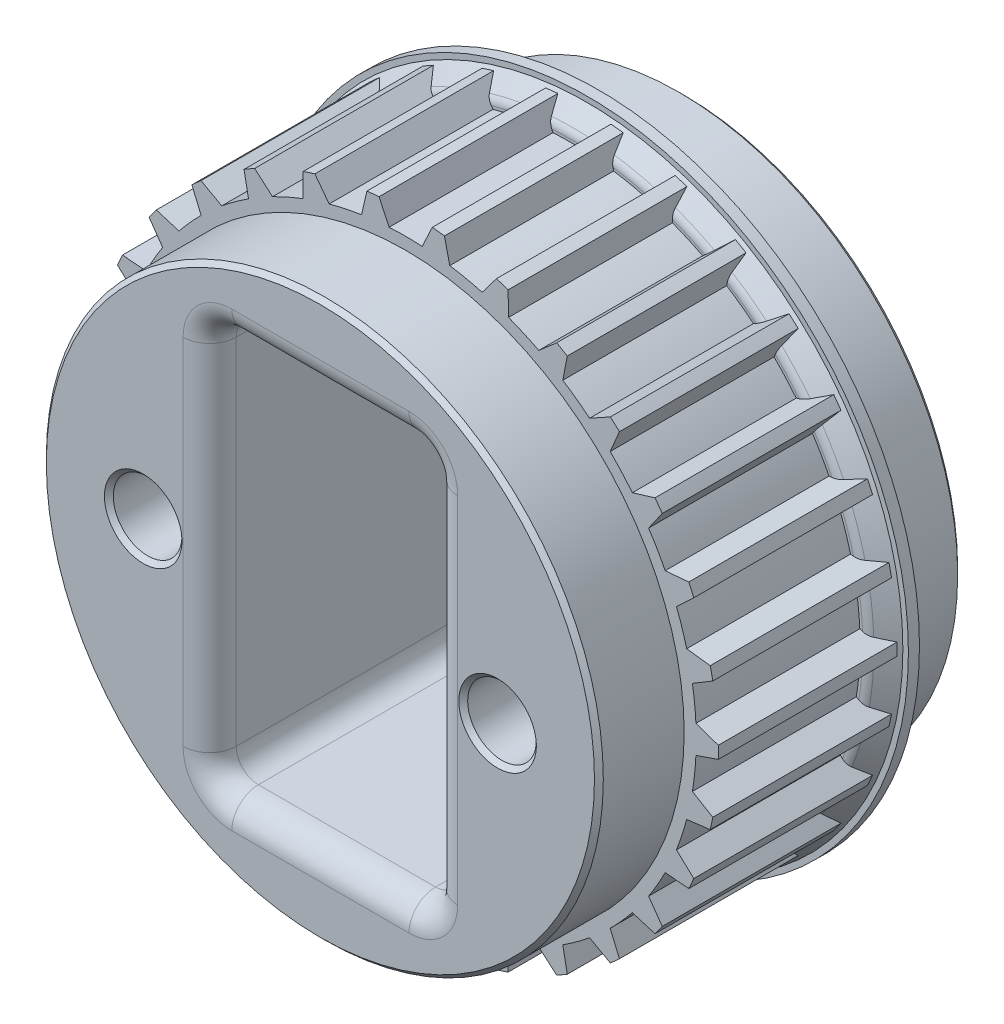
from build123d import *

# Parameters (mm, degrees)
SCHNITT_LINEAR_AUSTRAGEN1_DEPTH      = 22.586773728
KREISMUSTER1_COUNT                   = 30
SCHNITT_LINEAR_AUSTRAGEN2_DEPTH      = 23.084836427
SCHNITT_LINEAR_AUSTRAGEN2_DEPTH_BACK = 23.084836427
SKIZZE4_R                            = 1.55
VERRUNDUNG1_R                        = 1.2
FASE1_SIZE                           = 0.2


with BuildPart() as part:
    # Skizze1 → Rotation1 (revolve)
    with BuildSketch(Plane(origin=(0, 0, 0), x_dir=(0, 0, -1), z_dir=(1, 0, 0)), mode=Mode.PRIVATE) as rotation1_sk:
        Polygon((-4.35, 14.12), (4.35, 14.12), (4.35, 12.575), (8.2, 12.575), (8.2, 0), (-8.2, 0), (-8.2, 12.575), (-4.35, 12.575), align=None)
    revolve(rotation1_sk.sketch.rotate(Axis((0, 0, 46.515199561), (0, 0, -1)), 90), axis=Axis((0, 0, 46.515199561), (0, 0, -1)))

    # Skizze2 → Schnitt-Linear austragen1 (cut, symmetric)
    with BuildSketch(Plane.XY):
        with BuildLine():
            Line((-1.2, 14.068916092), (-0.747573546, 13.09868443))
            ThreePointArc((-0.747573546, 13.09868443), (0, 13.12), (0.747573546, 13.09868443))
            Line((0.747573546, 13.09868443), (1.2, 14.068916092))
            ThreePointArc((1.2, 14.068916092), (0, 14.12), (-1.2, 14.068916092))
        make_face()
    schnitt_linear_austragen1 = extrude(amount=SCHNITT_LINEAR_AUSTRAGEN1_DEPTH, both=True, mode=Mode.SUBTRACT)

    # Kreismuster1: Schnitt-Linear austragen1 ×30 about axis
    kreismuster1_axis = Axis((0, 0, 0), (0, 0, 1))
    for i in range(1, KREISMUSTER1_COUNT):
        add(schnitt_linear_austragen1.rotate(kreismuster1_axis, i * 360 / KREISMUSTER1_COUNT), mode=Mode.SUBTRACT)

    # Skizze3 → Rotation2 (revolve)
    with BuildSketch(Plane(origin=(0, 0, 0), x_dir=(0, 0, -1), z_dir=(1, 0, 0)), mode=Mode.PRIVATE) as rotation2_sk:
        with BuildLine():
            Line((4.35, 13), (4.35, 14.5))
            Line((4.35, 14.5), (3.85, 14.5))
            Line((3.85, 14.5), (3.85, 14.25))
            Line((3.85, 14.25), (3.196446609, 13.596446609))
            ThreePointArc((3.196446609, 13.596446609), (3.088060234, 13.434234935), (3.05, 13.242893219))
            Line((3.05, 13.242893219), (3.05, 13))
            Line((3.05, 13), (4.35, 13))
        make_face()
    revolve(rotation2_sk.sketch.rotate(Axis((0, 0, -11.03129214), (0, 0, 1)), 90), axis=Axis((0, 0, -11.03129214), (0, 0, 1)))

    # Skizze4 → Schnitt-Linear austragen2 (cut, two sides: drawn at the far end of the back side and taken through both)
    with BuildSketch(Plane.XY.offset(-SCHNITT_LINEAR_AUSTRAGEN2_DEPTH_BACK)):
        with Locations((-8, 0)):
            Circle(SKIZZE4_R)
        with Locations(Location((8, 0, 0), (0, 0, 180))):
            Circle(SKIZZE4_R)
        with BuildLine():
            Line((4, 9), (-4, 9))
            ThreePointArc((-4, 9), (-4.707106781, 8.707106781), (-5, 8))
            Line((-5, 8), (-5, -8))
            ThreePointArc((-5, -8), (-4.707106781, -8.707106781), (-4, -9))
            Line((-4, -9), (4, -9))
            ThreePointArc((4, -9), (4.707106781, -8.707106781), (5, -8))
            Line((5, -8), (5, 8))
            ThreePointArc((5, 8), (4.707106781, 8.707106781), (4, 9))
        make_face()
    extrude(amount=SCHNITT_LINEAR_AUSTRAGEN2_DEPTH + SCHNITT_LINEAR_AUSTRAGEN2_DEPTH_BACK, mode=Mode.SUBTRACT)

    # Verrundung1
    verrundung1_edges = [part.edges().sort_by_distance(p)[0] for p in [
        (-4.707106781, 8.707106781, -8.2),
        (0, 9, -8.2),
        (4.707106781, 8.707106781, -8.2),
        (5, 0, -8.2),
        (4.707106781, -8.707106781, -8.2),
        (0, -9, -8.2),
        (-4.707106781, -8.707106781, -8.2),
        (-5, 0, -8.2),
        (-4.707106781, 8.707106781, 8.2),
        (-5, 0, 8.2),
        (-4.707106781, -8.707106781, 8.2),
        (0, -9, 8.2),
        (4.707106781, -8.707106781, 8.2),
        (5, 0, 8.2),
        (4.707106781, 8.707106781, 8.2),
        (0, 9, 8.2),
    ]]
    fillet(verrundung1_edges, radius=VERRUNDUNG1_R)

    # Fase1
    fase1_edges = [part.edges().sort_by_distance(p)[0] for p in [
        (9.55, 0, -8.2),
        (9.55, 0, 8.2),
        (-9.55, 0, -8.2),
        (-9.55, 0, 8.2),
        (-12.575, 0, -8.2),
        (-12.575, 0, 8.2),
    ]]
    chamfer(fase1_edges, length=FASE1_SIZE)


solid = part.part
